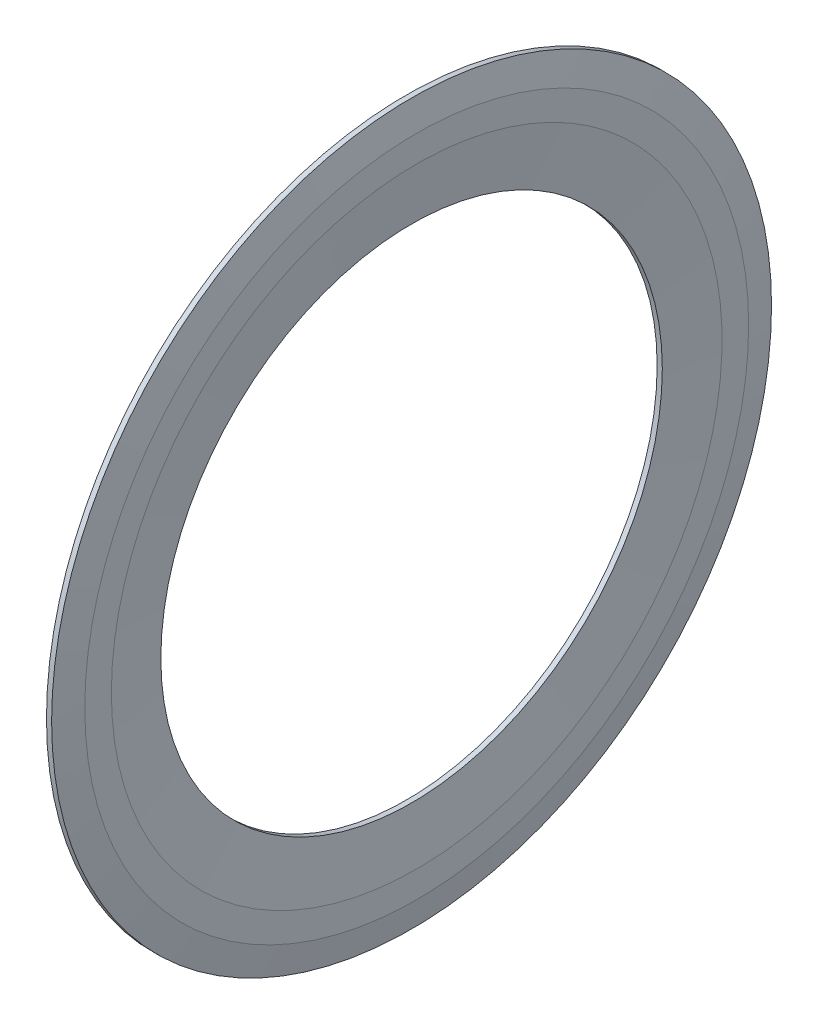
from build123d import *


with BuildPart() as part:
    # Sketch1 → Revolve1 (revolve)
    with BuildSketch(Plane.XY, mode=Mode.PRIVATE) as revolve1_sk:
        Polygon((0.31, 5.05), (0.4135, 5.05), (0.517, 6.15), (0.517, 6.685392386), (0.4135, 7.25), (0.31, 7.25), (0.36175, 6.7), (0.31, 6.15), align=None)
    revolve(revolve1_sk.sketch.rotate(Axis((0.4135, 0, 0), (-1, 0, 0)), 270), axis=Axis((0.4135, 0, 0), (-1, 0, 0)))


solid = part.part
